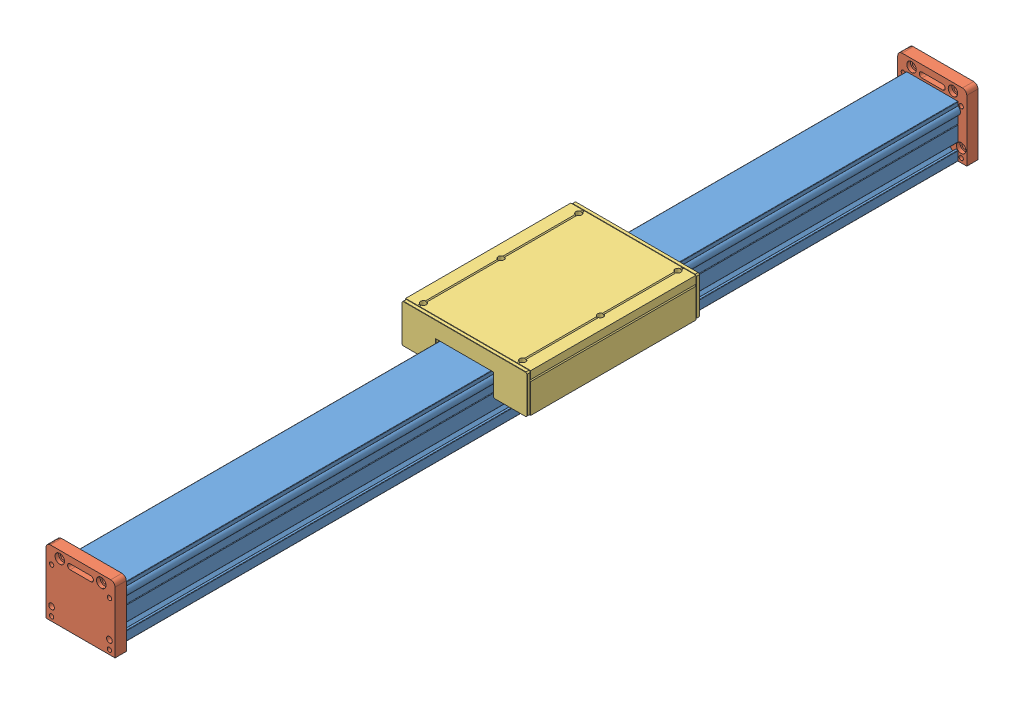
SolidWorks assembly MO_060_200_1000.SLDASM, configuration Standard (file format 3800). Lengths in mm.
Overall size (145 80 1000).
4 component instances, 3 part files, 11 mates.
Components (placement in the parent):
- Profil_MZ060-1: Profil_MZ060.SLDPRT [l=974] at (0 30 0) x (-1 0 0) z (0 0 1) size (65.5 60 974)
- Adapterplatte_MZS060-1: Adapterplatte_MZS060.SLDPRT [Standard] at (0 0 974) size (80 76 13)
- Adapterplatte_MZS060-2: Adapterplatte_MZS060.SLDPRT [Standard] x (-1 0 0) z (0 0 -1) size (80 76 13)
- Schlitten_MO_060_200-1: Schlitten_MO_060_200.SLDPRT [Standard] at (0 0 442.0954) size (145 45 200)
Mates (geometry in assembly coordinates):
- Deckungsgleich1: coincident aligned: plane of Profil_MZ060-1 through (0 30 0) normal (0 0 1)
- Deckungsgleich2: coincident anti-aligned: unknown of Profil_MZ060-1
- Deckungsgleich3: coincident anti-aligned: unknown of Profil_MZ060-1
- Deckungsgleich4: coincident anti-aligned: plane of Adapterplatte_MZS060-2 through (40 0 0) normal (0 0 1); plane of Profil_MZ060-1 through (-30 60 0) normal (0 0 -1)
- Deckungsgleich5: coincident aligned: plane of Profil_MZ060-1 through (-30 0 974) normal (0 -1 0); plane of Adapterplatte_MZS060-2 through (40 0 -13) normal (0 -1 0)
- Breite1: width: plane of Adapterplatte_MZS060-2 through (-40 0 -13) normal (-1 0 0); plane of Adapterplatte_MZS060-2 through (40 0 -13) normal (1 0 0); plane of Profil_MZ060-1 through (-30 60 974) normal (-1 0 0); plane of Profil_MZ060-1 through (30 0 974) normal (1 0 0)
- Deckungsgleich6: coincident anti-aligned: plane of Profil_MZ060-1 through (-30 60 974) normal (0 0 1); plane of Adapterplatte_MZS060-1 through (-40 0 974) normal (0 0 -1)
- Deckungsgleich7: coincident aligned: plane of Profil_MZ060-1 through (-30 0 974) normal (0 -1 0); plane of Adapterplatte_MZS060-1 through (-40 0 987) normal (0 -1 0)
- Breite2: width: plane of Adapterplatte_MZS060-1 through (-40 0 987) normal (-1 0 0); plane of Adapterplatte_MZS060-1 through (40 0 987) normal (1 0 0); plane of Profil_MZ060-1 through (30 0 974) normal (1 0 0); plane of Profil_MZ060-1 through (-30 60 974) normal (-1 0 0)
- Abstand1: distance = 80 mm anti-aligned: plane of Schlitten_MO_060_200-1 through (72.5 80 538.0954) normal (0 1 0); plane of Profil_MZ060-1 through (-30 0 974) normal (0 -1 0)
- Breite3: width: plane of Schlitten_MO_060_200-1 through (72.5 80 538.0954) normal (1 0 0); plane of Schlitten_MO_060_200-1 through (-72.5 80 538.0954) normal (-1 0 0); plane of Profil_MZ060-1 through (30 0 974) normal (1 0 0); plane of Profil_MZ060-1 through (-30 60 974) normal (-1 0 0)
